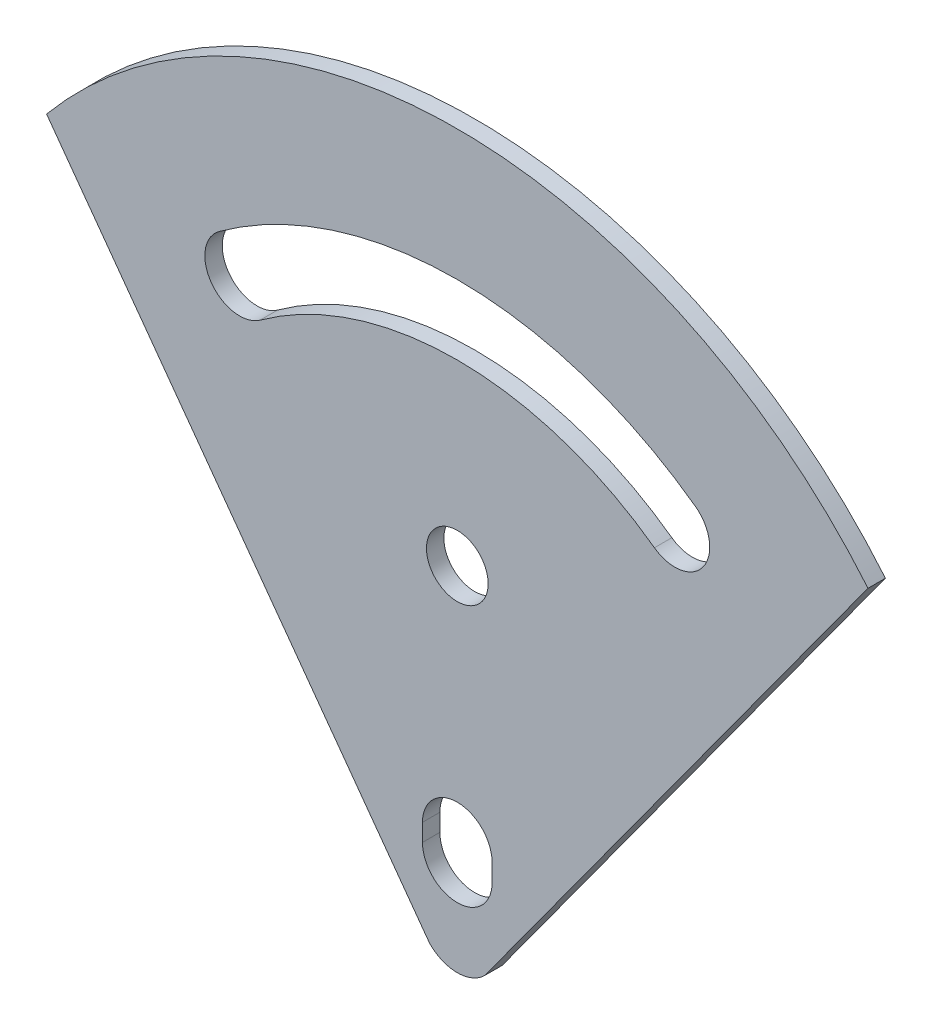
from build123d import *

# Parameters (mm, degrees)
BOSS_EXTRUDE1_DEPTH  = 2.54
CUT_EXTRUDE1_DEPTH   = 5.08
M8_CLEARANCE_HOLE1_D = 9


with BuildPart() as part:
    # Sketch1 → Boss-Extrude1 (new body)
    with BuildSketch(Plane.XY):
        with BuildLine():
            Line((0, 0), (-59.924516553, 82.389363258))
            ThreePointArc((-59.924516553, 82.389363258), (0, 110.49), (59.924516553, 82.389363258))
            Line((59.924516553, 82.389363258), (0, 0))
        make_face()
        with BuildLine():
            Line((5.08, 20.32), (5.08, 17.78))
            ThreePointArc((5.08, 17.78), (0, 12.7), (-5.08, 17.78))
            Line((-5.08, 17.78), (-5.08, 20.32))
            ThreePointArc((-5.08, 20.32), (0, 25.4), (5.08, 20.32))
        make_face(mode=Mode.SUBTRACT)
        with BuildLine():
            ThreePointArc((34.736987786, 80.148414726), (0, 91.44), (-34.736987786, 80.148414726))
            ThreePointArc((-34.736987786, 80.148414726), (-35.859051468, 73.052375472), (-28.763012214, 71.93031179))
            ThreePointArc((-28.763012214, 71.93031179), (0, 81.28), (28.763012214, 71.93031179))
            ThreePointArc((28.763012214, 71.93031179), (35.859051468, 73.052375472), (34.736987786, 80.148414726))
        make_face(mode=Mode.SUBTRACT)
    extrude(amount=BOSS_EXTRUDE1_DEPTH)

    # Sketch2 → Cut-Extrude1 (cut)
    with BuildSketch(Plane.XY.offset(2.54)):
        with BuildLine():
            Line((-4.00687886, 5.509000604), (0, 0))
            Line((0, 0), (4.00687886, 5.509000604))
            ThreePointArc((4.00687886, 5.509000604), (0, 3.849297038), (-4.00687886, 5.509000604))
        make_face()
    extrude(amount=-CUT_EXTRUDE1_DEPTH, mode=Mode.SUBTRACT)

    # M8 Clearance Hole1 (through all)
    with Locations(Plane.XY.offset(2.54)):
        with Locations((0, 55.245)):
            Hole(M8_CLEARANCE_HOLE1_D / 2)


solid = part.part
